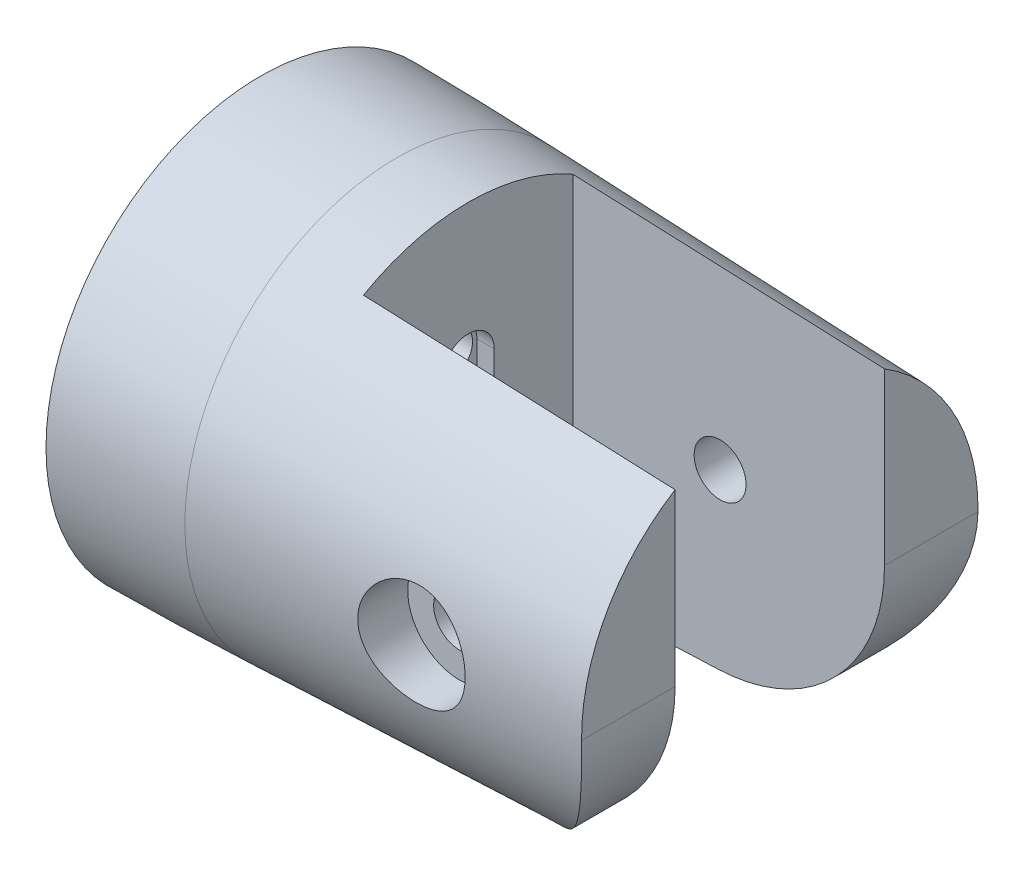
ISO-10303-21;
HEADER;
FILE_DESCRIPTION(('STEP AP214'),'2;1');
FILE_NAME('part.step','',(''),(''),'','','');
FILE_SCHEMA(('AUTOMOTIVE_DESIGN { 1 0 10303 214 1 1 1 1 }'));
ENDSEC;
DATA;
#1=APPLICATION_CONTEXT('core data for automotive mechanical design processes');
#2=APPLICATION_PROTOCOL_DEFINITION('international standard','automotive_design',2000,#1);
#3=PRODUCT_CONTEXT('',#1,'mechanical');
#4=PRODUCT('Part','Part','',(#3));
#5=PRODUCT_RELATED_PRODUCT_CATEGORY('part','',(#4));
#6=PRODUCT_DEFINITION_FORMATION('','',#4);
#7=PRODUCT_DEFINITION_CONTEXT('part definition',#1,'design');
#8=PRODUCT_DEFINITION('design','',#6,#7);
#9=PRODUCT_DEFINITION_SHAPE('','',#8);
#10=(LENGTH_UNIT() NAMED_UNIT(*) SI_UNIT(.MILLI.,.METRE.));
#11=(NAMED_UNIT(*) PLANE_ANGLE_UNIT() SI_UNIT($,.RADIAN.));
#12=(NAMED_UNIT(*) SI_UNIT($,.STERADIAN.) SOLID_ANGLE_UNIT());
#13=UNCERTAINTY_MEASURE_WITH_UNIT(LENGTH_MEASURE(1.E-05),#10,'distance_accuracy_value','');
#14=(GEOMETRIC_REPRESENTATION_CONTEXT(3) GLOBAL_UNCERTAINTY_ASSIGNED_CONTEXT((#13)) GLOBAL_UNIT_ASSIGNED_CONTEXT((#10,
#11,#12)) REPRESENTATION_CONTEXT('',''));
#15=CARTESIAN_POINT('',(0.,0.,0.));
#16=DIRECTION('',(0.,0.,1.));
#17=DIRECTION('',(1.,0.,0.));
#18=AXIS2_PLACEMENT_3D('',#15,#16,#17);
#19=CARTESIAN_POINT('',(20.5,-0.0779261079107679,-12.5));
#20=DIRECTION('',(0.,0.,1.));
#21=DIRECTION('',(1.,0.,0.));
#22=AXIS2_PLACEMENT_3D('',#19,#20,#21);
#23=CYLINDRICAL_SURFACE('',#22,1.5);
#24=CARTESIAN_POINT('',(20.5,-0.0779261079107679,-6.05));
#25=DIRECTION('',(0.,0.,-1.));
#26=DIRECTION('',(-1.,0.,0.));
#27=AXIS2_PLACEMENT_3D('',#24,#25,#26);
#28=CIRCLE('',#27,1.5);
#29=CARTESIAN_POINT('',(19.,-0.0779261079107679,-6.05));
#30=VERTEX_POINT('',#29);
#31=EDGE_CURVE('E244',#30,#30,#28,.T.);
#32=ORIENTED_EDGE('',*,*,#31,.F.);
#33=EDGE_LOOP('',(#32));
#34=FACE_BOUND('',#33,.T.);
#35=CARTESIAN_POINT('',(20.5,-0.0779261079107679,-9.));
#36=DIRECTION('',(0.,0.,-1.));
#37=DIRECTION('',(-1.,0.,0.));
#38=AXIS2_PLACEMENT_3D('',#35,#36,#37);
#39=CIRCLE('',#38,1.5);
#40=CARTESIAN_POINT('',(19.,-0.0779261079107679,-9.));
#41=VERTEX_POINT('',#40);
#42=EDGE_CURVE('E39',#41,#41,#39,.F.);
#43=ORIENTED_EDGE('',*,*,#42,.F.);
#44=EDGE_LOOP('',(#43));
#45=FACE_BOUND('',#44,.T.);
#46=ADVANCED_FACE('F35',(#34,#45),#23,.F.);
#47=CARTESIAN_POINT('',(20.5,-0.0779261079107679,6.05));
#48=DIRECTION('',(0.,0.,1.));
#49=DIRECTION('',(1.,0.,0.));
#50=AXIS2_PLACEMENT_3D('',#47,#48,#49);
#51=CIRCLE('',#50,1.5);
#52=CARTESIAN_POINT('',(22.,-0.0779261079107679,6.05));
#53=VERTEX_POINT('',#52);
#54=EDGE_CURVE('E245',#53,#53,#51,.T.);
#55=ORIENTED_EDGE('',*,*,#54,.F.);
#56=EDGE_LOOP('',(#55));
#57=FACE_BOUND('',#56,.T.);
#58=CARTESIAN_POINT('',(20.5,-0.0779261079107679,9.));
#59=DIRECTION('',(0.,0.,1.));
#60=DIRECTION('',(1.,0.,0.));
#61=AXIS2_PLACEMENT_3D('',#58,#59,#60);
#62=CIRCLE('',#61,1.5);
#63=CARTESIAN_POINT('',(22.,-0.0779261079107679,9.));
#64=VERTEX_POINT('',#63);
#65=EDGE_CURVE('E192',#64,#64,#62,.F.);
#66=ORIENTED_EDGE('',*,*,#65,.F.);
#67=EDGE_LOOP('',(#66));
#68=FACE_BOUND('',#67,.T.);
#69=ADVANCED_FACE('F372',(#57,#68),#23,.F.);
#70=CARTESIAN_POINT('',(-2.61885806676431,0.,0.));
#71=DIRECTION('',(-1.,0.,0.));
#72=DIRECTION('',(0.,0.,1.));
#73=AXIS2_PLACEMENT_3D('',#70,#71,#72);
#74=DEGENERATE_TOROIDAL_SURFACE('',#73,287.591410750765,300.,.F.);
#75=CARTESIAN_POINT('',(7.85099094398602,0.,0.));
#76=DIRECTION('',(-1.,0.,0.));
#77=DIRECTION('',(0.,0.,1.));
#78=AXIS2_PLACEMENT_3D('',#75,#76,#77);
#79=CIRCLE('',#78,12.2258373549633);
#80=CARTESIAN_POINT('',(7.85099094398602,0.,12.2258373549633));
#81=VERTEX_POINT('',#80);
#82=EDGE_CURVE('E324',#81,#81,#79,.F.);
#83=ORIENTED_EDGE('',*,*,#82,.F.);
#84=EDGE_LOOP('',(#83));
#85=FACE_BOUND('',#84,.T.);
#86=CARTESIAN_POINT('',(0.,0.,0.));
#87=DIRECTION('',(-1.,0.,0.));
#88=DIRECTION('',(0.,0.,1.));
#89=AXIS2_PLACEMENT_3D('',#86,#87,#88);
#90=CIRCLE('',#89,12.3971583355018);
#91=CARTESIAN_POINT('',(0.,0.,12.3971583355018));
#92=VERTEX_POINT('',#91);
#93=EDGE_CURVE('E163',#92,#92,#90,.F.);
#94=ORIENTED_EDGE('',*,*,#93,.T.);
#95=EDGE_LOOP('',(#94));
#96=FACE_BOUND('',#95,.T.);
#97=ADVANCED_FACE('F37',(#85,#96),#74,.F.);
#98=CARTESIAN_POINT('',(0.,0.,0.));
#99=DIRECTION('',(-1.,0.,0.));
#100=DIRECTION('',(0.,0.,-1.));
#101=AXIS2_PLACEMENT_3D('',#98,#99,#100);
#102=CONICAL_SURFACE('',#101,12.5,0.0349065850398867);
#103=CARTESIAN_POINT('',(27.1790693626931,2.92207389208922,-11.1751711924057));
#104=CARTESIAN_POINT('',(24.5172285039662,2.92207389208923,-11.2712460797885));
#105=CARTESIAN_POINT('',(21.8553849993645,2.92207389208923,-11.3672475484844));
#106=CARTESIAN_POINT('',(16.5316926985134,2.92207389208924,-11.5591036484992));
#107=CARTESIAN_POINT('',(13.869843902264,2.92207389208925,-11.6549582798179));
#108=CARTESIAN_POINT('',(11.2079924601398,2.92207389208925,-11.7507394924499));
#109=B_SPLINE_CURVE_WITH_KNOTS('',3,(#103,#104,#105,#106,#107,#108),.UNSPECIFIED.,.F.,.F.,(4,2,
4),(0.,7.99072237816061,15.981444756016),.UNSPECIFIED.);
#110=CARTESIAN_POINT('',(22.2320508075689,2.92207389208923,-11.3536430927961));
#111=VERTEX_POINT('',#110);
#112=CARTESIAN_POINT('',(18.7679491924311,2.92207389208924,-11.4785121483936));
#113=VERTEX_POINT('',#112);
#114=EDGE_CURVE('E44',#111,#113,#109,.T.);
#115=ORIENTED_EDGE('',*,*,#114,.T.);
#116=CARTESIAN_POINT('',(16.9422726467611,-0.240090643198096,0.));
#117=DIRECTION('',(-0.866025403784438,0.500000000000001,0.));
#118=DIRECTION('',(-0.500000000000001,-0.866025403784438,0.));
#119=AXIS2_PLACEMENT_3D('',#116,#117,#118);
#120=ELLIPSE('',#119,13.7505929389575,11.9059422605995);
#121=CARTESIAN_POINT('',(17.0358983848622,-0.0779261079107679,-11.9048382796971));
#122=VERTEX_POINT('',#121);
#123=EDGE_CURVE('E11',#113,#122,#120,.T.);
#124=ORIENTED_EDGE('',*,*,#123,.T.);
#125=CARTESIAN_POINT('',(16.8522547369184,0.240154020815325,0.));
#126=DIRECTION('',(-0.86602540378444,-0.499999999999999,0.));
#127=DIRECTION('',(-0.499999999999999,0.86602540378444,0.));
#128=AXIS2_PLACEMENT_3D('',#125,#126,#127);
#129=ELLIPSE('',#128,13.7542227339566,11.9090851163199);
#130=CARTESIAN_POINT('',(18.7679491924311,-3.07792610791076,-11.437706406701));
#131=VERTEX_POINT('',#130);
#132=EDGE_CURVE('E161',#122,#131,#129,.T.);
#133=ORIENTED_EDGE('',*,*,#132,.T.);
#134=CARTESIAN_POINT('',(11.2065309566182,-3.07792610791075,-11.7109351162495));
#135=CARTESIAN_POINT('',(13.8683706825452,-3.07792610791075,-11.6148288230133));
#136=CARTESIAN_POINT('',(16.5302074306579,-3.07792610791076,-11.5186401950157));
#137=CARTESIAN_POINT('',(21.8538749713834,-3.07792610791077,-11.3260982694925));
#138=CARTESIAN_POINT('',(24.5157057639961,-3.07792610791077,-11.2297449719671));
#139=CARTESIAN_POINT('',(27.1775335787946,-3.07792610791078,-11.13330933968));
#140=B_SPLINE_CURVE_WITH_KNOTS('',3,(#134,#135,#136,#137,#138,#139),.UNSPECIFIED.,.F.,.F.,(4,2,
4),(0.,7.99072237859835,15.9814447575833),.UNSPECIFIED.);
#141=CARTESIAN_POINT('',(22.2320508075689,-3.07792610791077,-11.3123869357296));
#142=VERTEX_POINT('',#141);
#143=EDGE_CURVE('E417',#131,#142,#140,.T.);
#144=ORIENTED_EDGE('',*,*,#143,.T.);
#145=CARTESIAN_POINT('',(23.8732932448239,-0.235210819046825,0.));
#146=DIRECTION('',(0.866025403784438,-0.500000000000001,0.));
#147=DIRECTION('',(-0.500000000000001,-0.866025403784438,0.));
#148=AXIS2_PLACEMENT_3D('',#145,#146,#147);
#149=ELLIPSE('',#148,13.471113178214,11.6639548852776);
#150=CARTESIAN_POINT('',(23.9641016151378,-0.0779261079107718,-11.6628948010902));
#151=VERTEX_POINT('',#150);
#152=EDGE_CURVE('E415',#142,#151,#149,.T.);
#153=ORIENTED_EDGE('',*,*,#152,.T.);
#154=CARTESIAN_POINT('',(23.7832753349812,0.235274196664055,0.));
#155=DIRECTION('',(0.86602540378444,0.499999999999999,0.));
#156=DIRECTION('',(-0.499999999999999,0.86602540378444,0.));
#157=AXIS2_PLACEMENT_3D('',#154,#155,#156);
#158=ELLIPSE('',#157,13.474742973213,11.667097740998);
#159=EDGE_CURVE('E408',#151,#111,#158,.T.);
#160=ORIENTED_EDGE('',*,*,#159,.T.);
#161=EDGE_LOOP('',(#115,#124,#133,#144,#153,#160));
#162=FACE_BOUND('',#161,.T.);
#163=CARTESIAN_POINT('',(29.999999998,-0.122642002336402,-11.4517202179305));
#164=CARTESIAN_POINT('',(30.0000038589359,-0.242247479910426,-11.4504410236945));
#165=CARTESIAN_POINT('',(29.9978583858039,-0.361815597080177,-11.4473589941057));
#166=CARTESIAN_POINT('',(29.9892932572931,-0.600645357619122,-11.4376136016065));
#167=CARTESIAN_POINT('',(29.9828738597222,-0.719907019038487,-11.4309504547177));
#168=CARTESIAN_POINT('',(29.9572578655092,-1.07667308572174,-11.4056418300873));
#169=CARTESIAN_POINT('',(29.9317033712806,-1.31339392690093,-11.381674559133));
#170=CARTESIAN_POINT('',(29.864407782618,-1.78079599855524,-11.3203066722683));
#171=CARTESIAN_POINT('',(29.8227936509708,-2.01150981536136,-11.2830115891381));
#172=CARTESIAN_POINT('',(29.7241147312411,-2.4671840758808,-11.1957364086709));
#173=CARTESIAN_POINT('',(29.6670478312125,-2.69214372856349,-11.1457545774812));
#174=CARTESIAN_POINT('',(29.538581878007,-3.13420223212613,-11.0342582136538));
#175=CARTESIAN_POINT('',(29.4672260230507,-3.35132250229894,-10.9727784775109));
#176=CARTESIAN_POINT('',(29.3110507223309,-3.77740752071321,-10.8392634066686));
#177=CARTESIAN_POINT('',(29.2262253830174,-3.98636864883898,-10.767223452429));
#178=CARTESIAN_POINT('',(29.0440364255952,-4.39550202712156,-10.6136724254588));
#179=CARTESIAN_POINT('',(28.9466558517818,-4.59566189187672,-10.5321485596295));
#180=CARTESIAN_POINT('',(28.740428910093,-4.98635076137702,-10.3608953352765));
#181=CARTESIAN_POINT('',(28.6315800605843,-5.17687766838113,-10.2711642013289));
#182=CARTESIAN_POINT('',(28.3599994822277,-5.61835881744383,-10.0492793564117));
#183=CARTESIAN_POINT('',(28.1924974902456,-5.86480007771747,-9.91395103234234));
#184=CARTESIAN_POINT('',(27.8394654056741,-6.33814806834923,-9.63298446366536));
#185=CARTESIAN_POINT('',(27.6539288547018,-6.5650477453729,-9.48734253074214));
#186=CARTESIAN_POINT('',(27.2658831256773,-6.99976578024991,-9.1883595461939));
#187=CARTESIAN_POINT('',(27.0633267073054,-7.20752743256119,-9.03499757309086));
#188=CARTESIAN_POINT('',(26.6428040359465,-7.60325114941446,-8.72409066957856));
#189=CARTESIAN_POINT('',(26.4248401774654,-7.79121627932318,-8.56654639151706));
#190=CARTESIAN_POINT('',(25.9693548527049,-8.1510904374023,-8.24738240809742));
#191=CARTESIAN_POINT('',(25.7315251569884,-8.32259378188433,-8.08574511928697));
#192=CARTESIAN_POINT('',(25.240046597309,-8.64507016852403,-7.7657007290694));
#193=CARTESIAN_POINT('',(24.9863903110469,-8.79603347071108,-7.60729519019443));
#194=CARTESIAN_POINT('',(24.4633175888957,-9.07642055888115,-7.29962296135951));
#195=CARTESIAN_POINT('',(24.1939511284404,-9.20590809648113,-7.15033008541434));
#196=CARTESIAN_POINT('',(23.6378801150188,-9.44255883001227,-6.8678169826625));
#197=CARTESIAN_POINT('',(23.351196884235,-9.54974878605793,-6.73457757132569));
#198=CARTESIAN_POINT('',(22.7491429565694,-9.74287552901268,-6.49014756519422));
#199=CARTESIAN_POINT('',(22.4331428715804,-9.8280087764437,-6.37981384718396));
#200=CARTESIAN_POINT('',(21.9462639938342,-9.93301661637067,-6.24629503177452));
#201=CARTESIAN_POINT('',(21.7821345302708,-9.96420101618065,-6.20716132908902));
#202=CARTESIAN_POINT('',(21.4501467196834,-10.0185637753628,-6.14124312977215));
#203=CARTESIAN_POINT('',(21.2822909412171,-10.0417474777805,-6.11445038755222));
#204=CARTESIAN_POINT('',(20.996433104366,-10.0737677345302,-6.08086037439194));
#205=CARTESIAN_POINT('',(20.8790940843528,-10.084823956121,-6.07044011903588));
#206=CARTESIAN_POINT('',(20.6434375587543,-10.1028232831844,-6.05644972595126));
#207=CARTESIAN_POINT('',(20.525118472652,-10.1097573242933,-6.05289464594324));
#208=CARTESIAN_POINT('',(20.4066821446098,-10.114569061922,-6.05292405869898));
#209=B_SPLINE_CURVE_WITH_KNOTS('',3,(#163,#164,#165,#166,#167,#168,#169,#170,#171,#172,#173,
#174,#175,#176,#177,#178,#179,#180,#181,#182,#183,#184,#185,#186,#187,#188,#189,#190,#191,#192,
#193,#194,#195,#196,#197,#198,#199,#200,#201,#202,#203,#204,#205,#206,#207,#208),.UNSPECIFIED.,
.F.,.F.,(4,2,2,2,2,2,2,2,2,2,2,2,2,2,2,2,2,2,2,2,2,2,4),(0.,0.358768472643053,0.717515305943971,
1.43430564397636,2.14554164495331,2.85687490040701,3.56608927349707,4.27561482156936,
4.98610881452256,5.6967568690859,6.67714163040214,7.65787878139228,8.64143417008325,
9.62483703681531,10.6282978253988,11.6322328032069,12.6331320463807,13.6328230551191,
14.6649895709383,15.1792068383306,15.6930800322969,16.0477782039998,16.4032534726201),.UNSPECIFIED.);
#210=CARTESIAN_POINT('',(30.,-0.122842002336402,-11.4517180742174));
#211=VERTEX_POINT('',#210);
#212=CARTESIAN_POINT('',(20.4068821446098,-10.1145609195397,-6.05292406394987));
#213=VERTEX_POINT('',#212);
#214=EDGE_CURVE('E265',#211,#213,#209,.T.);
#215=ORIENTED_EDGE('',*,*,#214,.T.);
#216=CARTESIAN_POINT('',(21.0000000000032,-10.0904080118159,0.));
#217=DIRECTION('',(-0.0406882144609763,0.999171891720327,0.));
#218=DIRECTION('',(-0.999171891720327,-0.0406882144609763,0.));
#219=AXIS2_PLACEMENT_3D('',#216,#217,#218);
#220=ELLIPSE('',#219,289.190960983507,6.05293681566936);
#221=CARTESIAN_POINT('',(12.,-10.4569054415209,-6.05));
#222=VERTEX_POINT('',#221);
#223=EDGE_CURVE('E667',#213,#222,#220,.T.);
#224=ORIENTED_EDGE('',*,*,#223,.T.);
#225=CARTESIAN_POINT('',(12.,0.,0.));
#226=DIRECTION('',(-1.,0.,0.));
#227=DIRECTION('',(0.,0.,1.));
#228=AXIS2_PLACEMENT_3D('',#225,#226,#227);
#229=CIRCLE('',#228,12.080950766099);
#230=CARTESIAN_POINT('',(12.,-10.4569054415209,6.05));
#231=VERTEX_POINT('',#230);
#232=EDGE_CURVE('E317',#222,#231,#229,.T.);
#233=ORIENTED_EDGE('',*,*,#232,.T.);
#234=CARTESIAN_POINT('',(20.4068821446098,-10.1145609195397,6.05292406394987));
#235=VERTEX_POINT('',#234);
#236=EDGE_CURVE('E660',#231,#235,#220,.T.);
#237=ORIENTED_EDGE('',*,*,#236,.T.);
#238=CARTESIAN_POINT('',(20.4066821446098,-10.114569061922,6.05292405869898));
#239=CARTESIAN_POINT('',(20.5777279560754,-10.1076488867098,6.05279007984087));
#240=CARTESIAN_POINT('',(20.7484940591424,-10.096259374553,6.06027259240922));
#241=CARTESIAN_POINT('',(21.0876672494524,-10.0649590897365,6.0892993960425));
#242=CARTESIAN_POINT('',(21.25607875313,-10.0450674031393,6.11081224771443));
#243=CARTESIAN_POINT('',(21.5869051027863,-9.99752159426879,6.16629961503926));
#244=CARTESIAN_POINT('',(21.7493725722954,-9.96999410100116,6.20007340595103));
#245=CARTESIAN_POINT('',(22.0702876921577,-9.90755673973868,6.27845702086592));
#246=CARTESIAN_POINT('',(22.228732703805,-9.8726421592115,6.32307376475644));
#247=CARTESIAN_POINT('',(22.6096764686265,-9.77909227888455,6.44298176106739));
#248=CARTESIAN_POINT('',(22.8297393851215,-9.71677418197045,6.52313830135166));
#249=CARTESIAN_POINT('',(23.2600726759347,-9.57921662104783,6.69732376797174));
#250=CARTESIAN_POINT('',(23.47033864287,-9.50397141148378,6.79135886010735));
#251=CARTESIAN_POINT('',(23.8831738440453,-9.34079476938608,6.99008507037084));
#252=CARTESIAN_POINT('',(24.0856591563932,-9.25275761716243,7.09486260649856));
#253=CARTESIAN_POINT('',(24.4814357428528,-9.06513945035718,7.31107533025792));
#254=CARTESIAN_POINT('',(24.6747274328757,-8.96555895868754,7.42251021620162));
#255=CARTESIAN_POINT('',(25.143308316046,-8.70473371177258,7.70390680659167));
#256=CARTESIAN_POINT('',(25.4134505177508,-8.53682408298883,7.87630017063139));
#257=CARTESIAN_POINT('',(25.935623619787,-8.17696595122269,8.22361124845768));
#258=CARTESIAN_POINT('',(26.1876463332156,-7.98500668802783,8.39853006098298));
#259=CARTESIAN_POINT('',(26.67273606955,-7.57767980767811,8.74538920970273));
#260=CARTESIAN_POINT('',(26.9058528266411,-7.36237733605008,8.91733635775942));
#261=CARTESIAN_POINT('',(27.352857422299,-6.90789871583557,9.25438688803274));
#262=CARTESIAN_POINT('',(27.5667534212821,-6.668732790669,9.4194931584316));
#263=CARTESIAN_POINT('',(27.9260355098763,-6.22523984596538,9.7015164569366));
#264=CARTESIAN_POINT('',(28.0757499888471,-6.02583391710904,9.82067764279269));
#265=CARTESIAN_POINT('',(28.3617739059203,-5.61317305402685,10.0508005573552));
#266=CARTESIAN_POINT('',(28.4980862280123,-5.39992111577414,10.1617640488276));
#267=CARTESIAN_POINT('',(28.7559248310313,-4.96006476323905,10.3735811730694));
#268=CARTESIAN_POINT('',(28.8774605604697,-4.73346902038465,10.4744412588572));
#269=CARTESIAN_POINT('',(29.1043254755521,-4.26752028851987,10.6642306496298));
#270=CARTESIAN_POINT('',(29.209657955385,-4.02816990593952,10.7531623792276));
#271=CARTESIAN_POINT('',(29.3865098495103,-3.57852272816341,10.9036131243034));
#272=CARTESIAN_POINT('',(29.460739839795,-3.36999201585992,10.967232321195));
#273=CARTESIAN_POINT('',(29.5958634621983,-2.94577193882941,11.0838246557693));
#274=CARTESIAN_POINT('',(29.6567597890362,-2.73008403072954,11.1367999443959));
#275=CARTESIAN_POINT('',(29.7642561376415,-2.293061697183,11.2310870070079));
#276=CARTESIAN_POINT('',(29.8108796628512,-2.07173721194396,11.2724179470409));
#277=CARTESIAN_POINT('',(29.8891946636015,-1.6246092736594,11.3427246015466));
#278=CARTESIAN_POINT('',(29.9208932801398,-1.39880801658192,11.3717062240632));
#279=CARTESIAN_POINT('',(29.9631748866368,-0.997859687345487,11.4114476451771));
#280=CARTESIAN_POINT('',(29.9769727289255,-0.823307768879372,11.424891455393));
#281=CARTESIAN_POINT('',(29.9953915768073,-0.473406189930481,11.444093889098));
#282=CARTESIAN_POINT('',(30.0000180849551,-0.298057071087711,11.449857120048));
#283=CARTESIAN_POINT('',(29.999999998,-0.122642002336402,11.4517202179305));
#284=B_SPLINE_CURVE_WITH_KNOTS('',3,(#238,#239,#240,#241,#242,#243,#244,#245,#246,#247,#248,
#249,#250,#251,#252,#253,#254,#255,#256,#257,#258,#259,#260,#261,#262,#263,#264,#265,#266,#267,
#268,#269,#270,#271,#272,#273,#274,#275,#276,#277,#278,#279,#280,#281,#282,#283),.UNSPECIFIED.,
.F.,.F.,(4,2,2,2,2,2,2,2,2,2,2,2,2,2,2,2,2,2,2,2,2,2,4),(0.,0.513181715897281,1.02521741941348,
1.52922297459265,2.03355103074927,2.75941171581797,3.48559585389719,4.21816452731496,
4.95070002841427,6.03465007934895,7.11908685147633,8.20057153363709,9.28159486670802,
10.1099727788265,10.9381720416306,11.7658389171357,12.5933373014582,13.2835787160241,
13.9736805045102,14.662639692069,15.3512689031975,15.8777108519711,16.4038368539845),.UNSPECIFIED.);
#285=CARTESIAN_POINT('',(30.,-0.122842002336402,11.4517180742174));
#286=VERTEX_POINT('',#285);
#287=EDGE_CURVE('E258',#235,#286,#284,.T.);
#288=ORIENTED_EDGE('',*,*,#287,.T.);
#289=CARTESIAN_POINT('',(30.,0.,0.));
#290=DIRECTION('',(1.,0.,0.));
#291=DIRECTION('',(0.,0.,-1.));
#292=AXIS2_PLACEMENT_3D('',#289,#290,#291);
#293=CIRCLE('',#292,11.4523769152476);
#294=CARTESIAN_POINT('',(30.,9.72391058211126,6.05));
#295=VERTEX_POINT('',#294);
#296=EDGE_CURVE('E307',#295,#286,#293,.T.);
#297=ORIENTED_EDGE('',*,*,#296,.F.);
#298=CARTESIAN_POINT('',(-6.48507262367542,11.1964449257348,6.05000000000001));
#299=CARTESIAN_POINT('',(-2.64794589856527,11.0441321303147,6.05));
#300=CARTESIAN_POINT('',(1.18915358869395,10.8911308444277,6.05));
#301=CARTESIAN_POINT('',(8.86328985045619,10.5835350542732,6.05));
#302=CARTESIAN_POINT('',(12.7003266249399,10.4289405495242,6.05));
#303=CARTESIAN_POINT('',(20.3743269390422,10.1179421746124,6.05));
#304=CARTESIAN_POINT('',(24.2112904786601,9.96153830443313,6.05));
#305=CARTESIAN_POINT('',(31.885131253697,9.64664613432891,6.05));
#306=CARTESIAN_POINT('',(35.7220084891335,9.48815783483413,6.05));
#307=CARTESIAN_POINT('',(44.4627885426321,9.12435129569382,6.05));
#308=CARTESIAN_POINT('',(49.366659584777,8.91826819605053,6.05));
#309=CARTESIAN_POINT('',(59.174195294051,8.50126377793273,6.05));
#310=CARTESIAN_POINT('',(64.0778599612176,8.29034246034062,6.05));
#311=CARTESIAN_POINT('',(73.8849362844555,7.86244456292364,6.04999999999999));
#312=CARTESIAN_POINT('',(78.7883479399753,7.64546797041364,6.04999999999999));
#313=CARTESIAN_POINT('',(86.1432040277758,7.31415519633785,6.04999999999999));
#314=CARTESIAN_POINT('',(88.5947801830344,7.20274290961,6.04999999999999));
#315=CARTESIAN_POINT('',(93.4978292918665,6.97765955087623,6.04999999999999));
#316=CARTESIAN_POINT('',(95.9493022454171,6.8639884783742,6.04999999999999));
#317=CARTESIAN_POINT('',(98.4007153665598,6.7490332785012,6.04999999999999));
#318=B_SPLINE_CURVE_WITH_KNOTS('',3,(#298,#299,#300,#301,#302,#303,#304,#305,#306,#307,#308,
#309,#310,#311,#312,#313,#314,#315,#316,#317),.UNSPECIFIED.,.F.,.F.,(4,2,2,2,2,2,2,2,2,4),(0.,
11.5204456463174,23.0408947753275,34.5613440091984,46.0817908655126,60.8063870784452,
75.5309806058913,90.2556049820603,97.6179233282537,104.980243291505),.UNSPECIFIED.);
#319=CARTESIAN_POINT('',(12.,10.4569054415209,6.05));
#320=VERTEX_POINT('',#319);
#321=EDGE_CURVE('E293',#295,#320,#318,.F.);
#322=ORIENTED_EDGE('',*,*,#321,.T.);
#323=CARTESIAN_POINT('',(12.,10.4569054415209,-6.05));
#324=VERTEX_POINT('',#323);
#325=EDGE_CURVE('E314',#320,#324,#229,.T.);
#326=ORIENTED_EDGE('',*,*,#325,.T.);
#327=CARTESIAN_POINT('',(-6.48507262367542,11.1964449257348,-6.04999999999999));
#328=CARTESIAN_POINT('',(-2.64794589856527,11.0441321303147,-6.05));
#329=CARTESIAN_POINT('',(1.18915358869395,10.8911308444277,-6.05));
#330=CARTESIAN_POINT('',(8.86328985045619,10.5835350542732,-6.05));
#331=CARTESIAN_POINT('',(12.7003266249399,10.4289405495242,-6.05));
#332=CARTESIAN_POINT('',(20.3743269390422,10.1179421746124,-6.05));
#333=CARTESIAN_POINT('',(24.2112904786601,9.96153830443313,-6.05));
#334=CARTESIAN_POINT('',(31.885131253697,9.64664613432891,-6.05));
#335=CARTESIAN_POINT('',(35.7220084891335,9.48815783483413,-6.05));
#336=CARTESIAN_POINT('',(44.4627885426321,9.12435129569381,-6.05));
#337=CARTESIAN_POINT('',(49.366659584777,8.91826819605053,-6.05));
#338=CARTESIAN_POINT('',(59.174195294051,8.50126377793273,-6.05));
#339=CARTESIAN_POINT('',(64.0778599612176,8.29034246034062,-6.05));
#340=CARTESIAN_POINT('',(73.8849362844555,7.86244456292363,-6.05000000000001));
#341=CARTESIAN_POINT('',(78.7883479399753,7.64546797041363,-6.05000000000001));
#342=CARTESIAN_POINT('',(86.1432040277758,7.31415519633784,-6.05000000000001));
#343=CARTESIAN_POINT('',(88.5947801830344,7.20274290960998,-6.05000000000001));
#344=CARTESIAN_POINT('',(93.4978292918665,6.97765955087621,-6.05000000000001));
#345=CARTESIAN_POINT('',(95.9493022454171,6.86398847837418,-6.05000000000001));
#346=CARTESIAN_POINT('',(98.4007153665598,6.74903327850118,-6.05000000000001));
#347=B_SPLINE_CURVE_WITH_KNOTS('',3,(#327,#328,#329,#330,#331,#332,#333,#334,#335,#336,#337,
#338,#339,#340,#341,#342,#343,#344,#345,#346),.UNSPECIFIED.,.F.,.F.,(4,2,2,2,2,2,2,2,2,4),(0.,
11.5204456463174,23.0408947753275,34.5613440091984,46.0817908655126,60.8063870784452,
75.5309806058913,90.2556049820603,97.6179233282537,104.980243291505),.UNSPECIFIED.);
#348=CARTESIAN_POINT('',(30.,9.72391058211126,-6.05));
#349=VERTEX_POINT('',#348);
#350=EDGE_CURVE('E301',#324,#349,#347,.T.);
#351=ORIENTED_EDGE('',*,*,#350,.T.);
#352=EDGE_CURVE('E300',#211,#349,#293,.T.);
#353=ORIENTED_EDGE('',*,*,#352,.F.);
#354=EDGE_LOOP('',(#215,#224,#233,#237,#288,#297,#322,#326,#351,#353));
#355=FACE_BOUND('',#354,.T.);
#356=ORIENTED_EDGE('',*,*,#82,.T.);
#357=EDGE_LOOP('',(#356));
#358=FACE_BOUND('',#357,.T.);
#359=CARTESIAN_POINT('',(18.4443083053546,-2.26290474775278,11.6379498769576));
#360=CARTESIAN_POINT('',(18.5668948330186,-2.37823295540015,11.611164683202));
#361=CARTESIAN_POINT('',(18.699222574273,-2.48325037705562,11.5842300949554));
#362=CARTESIAN_POINT('',(18.9799703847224,-2.66982512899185,11.5325989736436));
#363=CARTESIAN_POINT('',(19.1283983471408,-2.75137087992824,11.5079035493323));
#364=CARTESIAN_POINT('',(19.437634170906,-2.88862231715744,11.4630879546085));
#365=CARTESIAN_POINT('',(19.5984553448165,-2.94429975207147,11.4429727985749));
#366=CARTESIAN_POINT('',(19.9278165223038,-3.02774756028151,11.4092799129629));
#367=CARTESIAN_POINT('',(20.0963539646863,-3.05552712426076,11.39570003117));
#368=CARTESIAN_POINT('',(20.4319507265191,-3.08175644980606,11.3764932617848));
#369=CARTESIAN_POINT('',(20.5989441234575,-3.08091211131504,11.3706786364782));
#370=CARTESIAN_POINT('',(20.93056281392,-3.05152963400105,11.3666088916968));
#371=CARTESIAN_POINT('',(21.0951882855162,-3.02299358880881,11.3683532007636));
#372=CARTESIAN_POINT('',(21.4139451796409,-2.93996867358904,11.3786047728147));
#373=CARTESIAN_POINT('',(21.5682215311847,-2.88601656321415,11.3869744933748));
#374=CARTESIAN_POINT('',(21.8656833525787,-2.75400441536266,11.4089332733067));
#375=CARTESIAN_POINT('',(22.0088676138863,-2.67594175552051,11.4225229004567));
#376=CARTESIAN_POINT('',(22.2830360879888,-2.4962217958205,11.4533522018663));
#377=CARTESIAN_POINT('',(22.4137399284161,-2.39414803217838,11.4706557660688));
#378=CARTESIAN_POINT('',(22.6565079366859,-2.17000116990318,11.5065346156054));
#379=CARTESIAN_POINT('',(22.7685692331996,-2.04792499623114,11.5251100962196));
#380=CARTESIAN_POINT('',(22.9736785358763,-1.78367237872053,11.5617408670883));
#381=CARTESIAN_POINT('',(23.0661870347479,-1.64107307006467,11.5797718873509));
#382=CARTESIAN_POINT('',(23.2259495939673,-1.34201983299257,11.6126096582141));
#383=CARTESIAN_POINT('',(23.2932048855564,-1.18556658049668,11.6274165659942));
#384=CARTESIAN_POINT('',(23.400067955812,-0.864129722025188,11.6519570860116));
#385=CARTESIAN_POINT('',(23.439837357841,-0.699202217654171,11.6617202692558));
#386=CARTESIAN_POINT('',(23.4910407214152,-0.364771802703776,11.6751756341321));
#387=CARTESIAN_POINT('',(23.5024790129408,-0.195269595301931,11.678868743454));
#388=CARTESIAN_POINT('',(23.496686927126,0.139525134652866,11.6798179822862));
#389=CARTESIAN_POINT('',(23.4800801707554,0.304828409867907,11.6772135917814));
#390=CARTESIAN_POINT('',(23.4199089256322,0.630249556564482,11.6662818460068));
#391=CARTESIAN_POINT('',(23.3763443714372,0.790367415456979,11.657954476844));
#392=CARTESIAN_POINT('',(23.2636562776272,1.10082523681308,11.6366979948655));
#393=CARTESIAN_POINT('',(23.1945566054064,1.25117417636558,11.623773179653));
#394=CARTESIAN_POINT('',(23.0327822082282,1.53829683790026,11.594971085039));
#395=CARTESIAN_POINT('',(22.9401042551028,1.67506869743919,11.5790934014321));
#396=CARTESIAN_POINT('',(22.7315186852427,1.93417544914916,11.5460578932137));
#397=CARTESIAN_POINT('',(22.6151699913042,2.05615295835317,11.5288803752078));
#398=CARTESIAN_POINT('',(22.3636018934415,2.27902747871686,11.495858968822));
#399=CARTESIAN_POINT('',(22.2283813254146,2.37992318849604,11.4800151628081));
#400=CARTESIAN_POINT('',(21.9416235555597,2.55844391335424,11.4518220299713));
#401=CARTESIAN_POINT('',(21.7899746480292,2.6358940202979,11.4394990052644));
#402=CARTESIAN_POINT('',(21.4754676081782,2.76413095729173,11.4204946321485));
#403=CARTESIAN_POINT('',(21.3126115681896,2.81492274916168,11.4138122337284));
#404=CARTESIAN_POINT('',(20.9841602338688,2.88741559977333,11.4075194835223));
#405=CARTESIAN_POINT('',(20.8187031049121,2.90972957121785,11.4077574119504));
#406=CARTESIAN_POINT('',(20.4865550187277,2.92664797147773,11.4154035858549));
#407=CARTESIAN_POINT('',(20.3198641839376,2.92125511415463,11.4228111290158));
#408=CARTESIAN_POINT('',(19.9927608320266,2.8833894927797,11.444205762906));
#409=CARTESIAN_POINT('',(19.8322905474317,2.85135102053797,11.4580857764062));
#410=CARTESIAN_POINT('',(19.5191817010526,2.76188302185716,11.4912235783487));
#411=CARTESIAN_POINT('',(19.3665440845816,2.70445043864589,11.5104820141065));
#412=CARTESIAN_POINT('',(19.0700572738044,2.56454737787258,11.5530709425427));
#413=CARTESIAN_POINT('',(18.9264427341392,2.48160243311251,11.5764746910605));
#414=CARTESIAN_POINT('',(18.6549623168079,2.29338793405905,11.6248874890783));
#415=CARTESIAN_POINT('',(18.5270994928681,2.18811406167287,11.649896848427));
#416=CARTESIAN_POINT('',(18.2868903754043,1.95456156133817,11.6998848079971));
#417=CARTESIAN_POINT('',(18.1750997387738,1.82570569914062,11.7248416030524));
#418=CARTESIAN_POINT('',(17.9747066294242,1.55052670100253,11.7714496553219));
#419=CARTESIAN_POINT('',(17.8861035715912,1.4042040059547,11.7931009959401));
#420=CARTESIAN_POINT('',(17.7352450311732,1.09891165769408,11.8307326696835));
#421=CARTESIAN_POINT('',(17.672841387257,0.940019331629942,11.8467448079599));
#422=CARTESIAN_POINT('',(17.575790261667,0.613444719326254,11.8715270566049));
#423=CARTESIAN_POINT('',(17.5411352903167,0.445764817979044,11.8802991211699));
#424=CARTESIAN_POINT('',(17.5015178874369,0.112562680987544,11.889428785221));
#425=CARTESIAN_POINT('',(17.4955771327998,-0.0528360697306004,11.8900648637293));
#426=CARTESIAN_POINT('',(17.5109222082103,-0.382211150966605,11.8835009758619));
#427=CARTESIAN_POINT('',(17.5322079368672,-0.546187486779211,11.8763010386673));
#428=CARTESIAN_POINT('',(17.6007043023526,-0.865565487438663,11.8548756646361));
#429=CARTESIAN_POINT('',(17.6475263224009,-1.02105817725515,11.8407558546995));
#430=CARTESIAN_POINT('',(17.7652932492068,-1.32189597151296,11.80681708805));
#431=CARTESIAN_POINT('',(17.8362310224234,-1.46724406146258,11.7869998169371));
#432=CARTESIAN_POINT('',(17.9900199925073,-1.72714546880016,11.7461119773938));
#433=CARTESIAN_POINT('',(18.070329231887,-1.8432869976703,11.7254960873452));
#434=CARTESIAN_POINT('',(18.2462604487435,-2.06298756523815,11.682604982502));
#435=CARTESIAN_POINT('',(18.3418841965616,-2.16654514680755,11.6603295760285));
#436=CARTESIAN_POINT('',(18.4443083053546,-2.26290474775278,11.6379498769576));
#437=B_SPLINE_CURVE_WITH_KNOTS('',3,(#359,#360,#361,#362,#363,#364,#365,#366,#367,#368,#369,
#370,#371,#372,#373,#374,#375,#376,#377,#378,#379,#380,#381,#382,#383,#384,#385,#386,#387,#388,
#389,#390,#391,#392,#393,#394,#395,#396,#397,#398,#399,#400,#401,#402,#403,#404,#405,#406,#407,
#408,#409,#410,#411,#412,#413,#414,#415,#416,#417,#418,#419,#420,#421,#422,#423,#424,#425,#426,
#427,#428,#429,#430,#431,#432,#433,#434,#435,#436),.UNSPECIFIED.,.T.,.F.,(4,2,2,2,2,2,2,2,2,2,2,
2,2,2,2,2,2,2,2,2,2,2,2,2,2,2,2,2,2,2,2,2,2,2,2,2,2,2,4),(0.,0.51078521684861,1.02182199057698,
1.53341557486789,2.04484056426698,2.54366258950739,3.04244690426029,3.53113979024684,
4.01988584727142,4.51783156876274,5.01585391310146,5.52620806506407,6.0365373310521,
6.54383961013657,7.05106435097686,7.54715812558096,8.04325310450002,8.53888555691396,
9.03458590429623,9.5405455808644,10.0465364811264,10.5562140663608,11.0657967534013,
11.5642160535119,12.0625865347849,12.5529898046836,13.0434521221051,13.543652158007,
14.043949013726,14.5587139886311,15.0734659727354,15.5852664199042,16.0969286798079,
16.5910289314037,17.0851273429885,17.57190815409,18.0585450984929,18.4852695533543,
18.912043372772),.UNSPECIFIED.);
#438=CARTESIAN_POINT('',(18.4443083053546,-2.26290474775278,11.6379498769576));
#439=VERTEX_POINT('',#438);
#440=EDGE_CURVE('E202',#439,#439,#437,.T.);
#441=ORIENTED_EDGE('',*,*,#440,.F.);
#442=EDGE_LOOP('',(#441));
#443=FACE_BOUND('',#442,.T.);
#444=ADVANCED_FACE('F270',(#162,#355,#358,#443),#102,.T.);
#445=CARTESIAN_POINT('',(30.,4.,0.));
#446=DIRECTION('',(-1.,0.,0.));
#447=DIRECTION('',(0.,0.,1.));
#448=AXIS2_PLACEMENT_3D('',#445,#446,#447);
#449=CYLINDRICAL_SURFACE('',#448,1.25);
#450=CARTESIAN_POINT('',(0.,4.,0.));
#451=DIRECTION('',(-1.,0.,0.));
#452=DIRECTION('',(0.,0.,1.));
#453=AXIS2_PLACEMENT_3D('',#450,#451,#452);
#454=CIRCLE('',#453,1.25);
#455=CARTESIAN_POINT('',(0.,4.,1.25));
#456=VERTEX_POINT('',#455);
#457=EDGE_CURVE('E196',#456,#456,#454,.F.);
#458=ORIENTED_EDGE('',*,*,#457,.F.);
#459=EDGE_LOOP('',(#458));
#460=FACE_BOUND('',#459,.T.);
#461=CARTESIAN_POINT('',(11.,4.,0.));
#462=DIRECTION('',(1.,0.,0.));
#463=DIRECTION('',(0.,0.,-1.));
#464=AXIS2_PLACEMENT_3D('',#461,#462,#463);
#465=CIRCLE('',#464,1.25);
#466=CARTESIAN_POINT('',(11.,4.,-1.25));
#467=VERTEX_POINT('',#466);
#468=EDGE_CURVE('E241',#467,#467,#465,.T.);
#469=ORIENTED_EDGE('',*,*,#468,.T.);
#470=EDGE_LOOP('',(#469));
#471=FACE_BOUND('',#470,.T.);
#472=ADVANCED_FACE('F367',(#460,#471),#449,.F.);
#473=CARTESIAN_POINT('',(30.,-4.,0.));
#474=DIRECTION('',(-1.,0.,0.));
#475=DIRECTION('',(0.,0.,1.));
#476=AXIS2_PLACEMENT_3D('',#473,#474,#475);
#477=CYLINDRICAL_SURFACE('',#476,1.25);
#478=CARTESIAN_POINT('',(0.,-4.,0.));
#479=DIRECTION('',(-1.,0.,0.));
#480=DIRECTION('',(0.,0.,1.));
#481=AXIS2_PLACEMENT_3D('',#478,#479,#480);
#482=CIRCLE('',#481,1.25);
#483=CARTESIAN_POINT('',(0.,-4.,1.25));
#484=VERTEX_POINT('',#483);
#485=EDGE_CURVE('E193',#484,#484,#482,.F.);
#486=ORIENTED_EDGE('',*,*,#485,.F.);
#487=EDGE_LOOP('',(#486));
#488=FACE_BOUND('',#487,.T.);
#489=CARTESIAN_POINT('',(11.,-4.,0.));
#490=DIRECTION('',(1.,0.,0.));
#491=DIRECTION('',(0.,0.,-1.));
#492=AXIS2_PLACEMENT_3D('',#489,#490,#491);
#493=CIRCLE('',#492,1.25);
#494=CARTESIAN_POINT('',(11.,-4.,-1.25));
#495=VERTEX_POINT('',#494);
#496=EDGE_CURVE('E235',#495,#495,#493,.T.);
#497=ORIENTED_EDGE('',*,*,#496,.T.);
#498=EDGE_LOOP('',(#497));
#499=FACE_BOUND('',#498,.T.);
#500=ADVANCED_FACE('F363',(#488,#499),#477,.F.);
#501=CARTESIAN_POINT('',(30.,0.,0.));
#502=DIRECTION('',(1.,0.,0.));
#503=DIRECTION('',(0.,0.,-1.));
#504=AXIS2_PLACEMENT_3D('',#501,#502,#503);
#505=PLANE('',#504);
#506=ORIENTED_EDGE('',*,*,#296,.T.);
#507=DIRECTION('',(0.,0.,1.));
#508=VECTOR('',#507,1.);
#509=CARTESIAN_POINT('',(30.,-0.122842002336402,-12.5));
#510=LINE('',#509,#508);
#511=CARTESIAN_POINT('',(30.,-0.122842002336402,6.05));
#512=VERTEX_POINT('',#511);
#513=EDGE_CURVE('E248',#512,#286,#510,.T.);
#514=ORIENTED_EDGE('',*,*,#513,.F.);
#515=DIRECTION('',(0.,-1.,0.));
#516=VECTOR('',#515,1.);
#517=CARTESIAN_POINT('',(30.,0.,6.05));
#518=LINE('',#517,#516);
#519=EDGE_CURVE('E311',#295,#512,#518,.T.);
#520=ORIENTED_EDGE('',*,*,#519,.F.);
#521=EDGE_LOOP('',(#506,#514,#520));
#522=FACE_BOUND('',#521,.T.);
#523=ADVANCED_FACE('F366',(#522),#505,.T.);
#524=DIRECTION('',(0.,1.,0.));
#525=VECTOR('',#524,1.);
#526=CARTESIAN_POINT('',(30.,0.,-6.05));
#527=LINE('',#526,#525);
#528=CARTESIAN_POINT('',(30.,-0.122842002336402,-6.05));
#529=VERTEX_POINT('',#528);
#530=EDGE_CURVE('E308',#529,#349,#527,.T.);
#531=ORIENTED_EDGE('',*,*,#530,.F.);
#532=EDGE_CURVE('E253',#211,#529,#510,.T.);
#533=ORIENTED_EDGE('',*,*,#532,.F.);
#534=ORIENTED_EDGE('',*,*,#352,.T.);
#535=EDGE_LOOP('',(#531,#533,#534));
#536=FACE_BOUND('',#535,.T.);
#537=ADVANCED_FACE('F576',(#536),#505,.T.);
#538=CARTESIAN_POINT('',(12.,-12.5,-6.05));
#539=DIRECTION('',(-1.,0.,0.));
#540=DIRECTION('',(0.,0.,1.));
#541=AXIS2_PLACEMENT_3D('',#538,#539,#540);
#542=PLANE('',#541);
#543=DIRECTION('',(0.,1.,0.));
#544=VECTOR('',#543,1.);
#545=CARTESIAN_POINT('',(12.,-4.,-1.5));
#546=LINE('',#545,#544);
#547=CARTESIAN_POINT('',(12.,-4.,-1.5));
#548=VERTEX_POINT('',#547);
#549=CARTESIAN_POINT('',(12.,4.,-1.5));
#550=VERTEX_POINT('',#549);
#551=EDGE_CURVE('E225',#548,#550,#546,.T.);
#552=ORIENTED_EDGE('',*,*,#551,.F.);
#553=CARTESIAN_POINT('',(12.,-4.,0.));
#554=DIRECTION('',(1.,0.,0.));
#555=DIRECTION('',(0.,0.,-1.));
#556=AXIS2_PLACEMENT_3D('',#553,#554,#555);
#557=CIRCLE('',#556,1.5);
#558=CARTESIAN_POINT('',(12.,-4.,1.5));
#559=VERTEX_POINT('',#558);
#560=EDGE_CURVE('E60',#559,#548,#557,.T.);
#561=ORIENTED_EDGE('',*,*,#560,.F.);
#562=DIRECTION('',(0.,-1.,0.));
#563=VECTOR('',#562,1.);
#564=CARTESIAN_POINT('',(12.,-4.,1.5));
#565=LINE('',#564,#563);
#566=CARTESIAN_POINT('',(12.,4.,1.5));
#567=VERTEX_POINT('',#566);
#568=EDGE_CURVE('E214',#567,#559,#565,.T.);
#569=ORIENTED_EDGE('',*,*,#568,.F.);
#570=CARTESIAN_POINT('',(12.,4.,0.));
#571=DIRECTION('',(1.,0.,0.));
#572=DIRECTION('',(0.,0.,-1.));
#573=AXIS2_PLACEMENT_3D('',#570,#571,#572);
#574=CIRCLE('',#573,1.5);
#575=EDGE_CURVE('E228',#550,#567,#574,.T.);
#576=ORIENTED_EDGE('',*,*,#575,.F.);
#577=EDGE_LOOP('',(#552,#561,#569,#576));
#578=FACE_BOUND('',#577,.T.);
#579=DIRECTION('',(0.,1.,0.));
#580=VECTOR('',#579,1.);
#581=CARTESIAN_POINT('',(12.,-12.5,6.05));
#582=LINE('',#581,#580);
#583=EDGE_CURVE('E669',#231,#320,#582,.T.);
#584=ORIENTED_EDGE('',*,*,#583,.F.);
#585=ORIENTED_EDGE('',*,*,#232,.F.);
#586=DIRECTION('',(0.,1.,0.));
#587=VECTOR('',#586,1.);
#588=CARTESIAN_POINT('',(12.,-12.5,-6.05));
#589=LINE('',#588,#587);
#590=EDGE_CURVE('E672',#222,#324,#589,.T.);
#591=ORIENTED_EDGE('',*,*,#590,.T.);
#592=ORIENTED_EDGE('',*,*,#325,.F.);
#593=EDGE_LOOP('',(#584,#585,#591,#592));
#594=FACE_BOUND('',#593,.T.);
#595=ADVANCED_FACE('F289',(#578,#594),#542,.F.);
#596=CARTESIAN_POINT('',(30.,-12.5,6.05));
#597=DIRECTION('',(0.,0.,1.));
#598=DIRECTION('',(1.,0.,0.));
#599=AXIS2_PLACEMENT_3D('',#596,#597,#598);
#600=PLANE('',#599);
#601=ORIENTED_EDGE('',*,*,#54,.T.);
#602=EDGE_LOOP('',(#601));
#603=FACE_BOUND('',#602,.T.);
#604=CARTESIAN_POINT('',(20.,-0.122842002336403,6.05));
#605=DIRECTION('',(0.,0.,1.));
#606=DIRECTION('',(1.,0.,0.));
#607=AXIS2_PLACEMENT_3D('',#604,#605,#606);
#608=CIRCLE('',#607,10.);
#609=CARTESIAN_POINT('',(20.4068821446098,-10.1145609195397,6.05));
#610=VERTEX_POINT('',#609);
#611=EDGE_CURVE('E255',#512,#610,#608,.F.);
#612=ORIENTED_EDGE('',*,*,#611,.T.);
#613=DIRECTION('',(-0.999171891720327,-0.0406882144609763,0.));
#614=VECTOR('',#613,1.);
#615=CARTESIAN_POINT('',(29.8871394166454,-9.72850648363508,6.05));
#616=LINE('',#615,#614);
#617=EDGE_CURVE('E663',#610,#231,#616,.T.);
#618=ORIENTED_EDGE('',*,*,#617,.T.);
#619=ORIENTED_EDGE('',*,*,#583,.T.);
#620=ORIENTED_EDGE('',*,*,#321,.F.);
#621=ORIENTED_EDGE('',*,*,#519,.T.);
#622=EDGE_LOOP('',(#612,#618,#619,#620,#621));
#623=FACE_BOUND('',#622,.T.);
#624=ADVANCED_FACE('F284',(#603,#623),#600,.F.);
#625=CARTESIAN_POINT('',(30.,-12.5,-6.05));
#626=DIRECTION('',(0.,0.,-1.));
#627=DIRECTION('',(-1.,0.,0.));
#628=AXIS2_PLACEMENT_3D('',#625,#626,#627);
#629=PLANE('',#628);
#630=ORIENTED_EDGE('',*,*,#31,.T.);
#631=EDGE_LOOP('',(#630));
#632=FACE_BOUND('',#631,.T.);
#633=ORIENTED_EDGE('',*,*,#590,.F.);
#634=DIRECTION('',(0.999171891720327,0.0406882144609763,0.));
#635=VECTOR('',#634,1.);
#636=CARTESIAN_POINT('',(29.8871394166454,-9.72850648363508,-6.05));
#637=LINE('',#636,#635);
#638=CARTESIAN_POINT('',(20.4068821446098,-10.1145609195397,-6.05));
#639=VERTEX_POINT('',#638);
#640=EDGE_CURVE('E321',#222,#639,#637,.T.);
#641=ORIENTED_EDGE('',*,*,#640,.T.);
#642=CARTESIAN_POINT('',(20.,-0.122842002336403,-6.05));
#643=DIRECTION('',(0.,0.,-1.));
#644=DIRECTION('',(-1.,0.,0.));
#645=AXIS2_PLACEMENT_3D('',#642,#643,#644);
#646=CIRCLE('',#645,10.);
#647=EDGE_CURVE('E318',#639,#529,#646,.F.);
#648=ORIENTED_EDGE('',*,*,#647,.T.);
#649=ORIENTED_EDGE('',*,*,#530,.T.);
#650=ORIENTED_EDGE('',*,*,#350,.F.);
#651=EDGE_LOOP('',(#633,#641,#648,#649,#650));
#652=FACE_BOUND('',#651,.T.);
#653=ADVANCED_FACE('F279',(#632,#652),#629,.F.);
#654=CARTESIAN_POINT('',(20.,-0.122842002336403,-12.5));
#655=DIRECTION('',(0.,0.,1.));
#656=DIRECTION('',(1.,0.,0.));
#657=AXIS2_PLACEMENT_3D('',#654,#655,#656);
#658=CYLINDRICAL_SURFACE('',#657,10.);
#659=ORIENTED_EDGE('',*,*,#532,.T.);
#660=ORIENTED_EDGE('',*,*,#647,.F.);
#661=DIRECTION('',(0.,0.,1.));
#662=VECTOR('',#661,1.);
#663=CARTESIAN_POINT('',(20.4068821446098,-10.1145609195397,-12.5));
#664=LINE('',#663,#662);
#665=EDGE_CURVE('E252',#213,#639,#664,.T.);
#666=ORIENTED_EDGE('',*,*,#665,.F.);
#667=ORIENTED_EDGE('',*,*,#214,.F.);
#668=EDGE_LOOP('',(#659,#660,#666,#667));
#669=FACE_BOUND('',#668,.T.);
#670=ADVANCED_FACE('F273',(#669),#658,.T.);
#671=CARTESIAN_POINT('',(20.4068821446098,-10.1145609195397,-12.5));
#672=DIRECTION('',(-0.0406882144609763,0.999171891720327,0.));
#673=DIRECTION('',(-0.999171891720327,-0.0406882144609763,0.));
#674=AXIS2_PLACEMENT_3D('',#671,#672,#673);
#675=PLANE('',#674);
#676=ORIENTED_EDGE('',*,*,#665,.T.);
#677=ORIENTED_EDGE('',*,*,#640,.F.);
#678=ORIENTED_EDGE('',*,*,#223,.F.);
#679=EDGE_LOOP('',(#676,#677,#678));
#680=FACE_BOUND('',#679,.T.);
#681=ADVANCED_FACE('F278',(#680),#675,.F.);
#682=ORIENTED_EDGE('',*,*,#617,.F.);
#683=EDGE_CURVE('E249',#610,#235,#664,.T.);
#684=ORIENTED_EDGE('',*,*,#683,.T.);
#685=ORIENTED_EDGE('',*,*,#236,.F.);
#686=EDGE_LOOP('',(#682,#684,#685));
#687=FACE_BOUND('',#686,.T.);
#688=ADVANCED_FACE('F282',(#687),#675,.F.);
#689=ORIENTED_EDGE('',*,*,#683,.F.);
#690=ORIENTED_EDGE('',*,*,#611,.F.);
#691=ORIENTED_EDGE('',*,*,#513,.T.);
#692=ORIENTED_EDGE('',*,*,#287,.F.);
#693=EDGE_LOOP('',(#689,#690,#691,#692));
#694=FACE_BOUND('',#693,.T.);
#695=ADVANCED_FACE('F281',(#694),#658,.T.);
#696=CARTESIAN_POINT('',(11.,-4.,0.));
#697=DIRECTION('',(1.,0.,0.));
#698=DIRECTION('',(0.,0.,-1.));
#699=AXIS2_PLACEMENT_3D('',#696,#697,#698);
#700=CYLINDRICAL_SURFACE('',#699,1.5);
#701=ORIENTED_EDGE('',*,*,#560,.T.);
#702=DIRECTION('',(1.,0.,0.));
#703=VECTOR('',#702,1.);
#704=CARTESIAN_POINT('',(11.,-4.,-1.5));
#705=LINE('',#704,#703);
#706=CARTESIAN_POINT('',(11.,-4.,-1.5));
#707=VERTEX_POINT('',#706);
#708=EDGE_CURVE('E223',#707,#548,#705,.T.);
#709=ORIENTED_EDGE('',*,*,#708,.F.);
#710=CARTESIAN_POINT('',(11.,-4.,0.));
#711=DIRECTION('',(1.,0.,0.));
#712=DIRECTION('',(0.,0.,-1.));
#713=AXIS2_PLACEMENT_3D('',#710,#711,#712);
#714=CIRCLE('',#713,1.5);
#715=CARTESIAN_POINT('',(11.,-4.,1.5));
#716=VERTEX_POINT('',#715);
#717=EDGE_CURVE('E210',#716,#707,#714,.T.);
#718=ORIENTED_EDGE('',*,*,#717,.F.);
#719=DIRECTION('',(1.,0.,0.));
#720=VECTOR('',#719,1.);
#721=CARTESIAN_POINT('',(11.,-4.,1.5));
#722=LINE('',#721,#720);
#723=EDGE_CURVE('E233',#716,#559,#722,.T.);
#724=ORIENTED_EDGE('',*,*,#723,.T.);
#725=EDGE_LOOP('',(#701,#709,#718,#724));
#726=FACE_BOUND('',#725,.T.);
#727=ADVANCED_FACE('F353',(#726),#700,.F.);
#728=CARTESIAN_POINT('',(11.,-4.,1.5));
#729=DIRECTION('',(0.,0.,1.));
#730=DIRECTION('',(1.,0.,0.));
#731=AXIS2_PLACEMENT_3D('',#728,#729,#730);
#732=PLANE('',#731);
#733=ORIENTED_EDGE('',*,*,#568,.T.);
#734=ORIENTED_EDGE('',*,*,#723,.F.);
#735=DIRECTION('',(0.,-1.,0.));
#736=VECTOR('',#735,1.);
#737=CARTESIAN_POINT('',(11.,-4.,1.5));
#738=LINE('',#737,#736);
#739=CARTESIAN_POINT('',(11.,4.,1.5));
#740=VERTEX_POINT('',#739);
#741=EDGE_CURVE('E220',#740,#716,#738,.T.);
#742=ORIENTED_EDGE('',*,*,#741,.F.);
#743=DIRECTION('',(1.,0.,0.));
#744=VECTOR('',#743,1.);
#745=CARTESIAN_POINT('',(11.,4.,1.5));
#746=LINE('',#745,#744);
#747=EDGE_CURVE('E236',#740,#567,#746,.T.);
#748=ORIENTED_EDGE('',*,*,#747,.T.);
#749=EDGE_LOOP('',(#733,#734,#742,#748));
#750=FACE_BOUND('',#749,.T.);
#751=ADVANCED_FACE('F349',(#750),#732,.F.);
#752=CARTESIAN_POINT('',(11.,4.,0.));
#753=DIRECTION('',(1.,0.,0.));
#754=DIRECTION('',(0.,0.,-1.));
#755=AXIS2_PLACEMENT_3D('',#752,#753,#754);
#756=CYLINDRICAL_SURFACE('',#755,1.5);
#757=ORIENTED_EDGE('',*,*,#575,.T.);
#758=ORIENTED_EDGE('',*,*,#747,.F.);
#759=CARTESIAN_POINT('',(11.,4.,0.));
#760=DIRECTION('',(1.,0.,0.));
#761=DIRECTION('',(0.,0.,-1.));
#762=AXIS2_PLACEMENT_3D('',#759,#760,#761);
#763=CIRCLE('',#762,1.5);
#764=CARTESIAN_POINT('',(11.,4.,-1.5));
#765=VERTEX_POINT('',#764);
#766=EDGE_CURVE('E217',#765,#740,#763,.T.);
#767=ORIENTED_EDGE('',*,*,#766,.F.);
#768=DIRECTION('',(1.,0.,0.));
#769=VECTOR('',#768,1.);
#770=CARTESIAN_POINT('',(11.,4.,-1.5));
#771=LINE('',#770,#769);
#772=EDGE_CURVE('E238',#765,#550,#771,.T.);
#773=ORIENTED_EDGE('',*,*,#772,.T.);
#774=EDGE_LOOP('',(#757,#758,#767,#773));
#775=FACE_BOUND('',#774,.T.);
#776=ADVANCED_FACE('F352',(#775),#756,.F.);
#777=CARTESIAN_POINT('',(11.,-4.,-1.5));
#778=DIRECTION('',(0.,0.,-1.));
#779=DIRECTION('',(-1.,0.,0.));
#780=AXIS2_PLACEMENT_3D('',#777,#778,#779);
#781=PLANE('',#780);
#782=ORIENTED_EDGE('',*,*,#551,.T.);
#783=ORIENTED_EDGE('',*,*,#772,.F.);
#784=DIRECTION('',(0.,1.,0.));
#785=VECTOR('',#784,1.);
#786=CARTESIAN_POINT('',(11.,-4.,-1.5));
#787=LINE('',#786,#785);
#788=EDGE_CURVE('E213',#707,#765,#787,.T.);
#789=ORIENTED_EDGE('',*,*,#788,.F.);
#790=ORIENTED_EDGE('',*,*,#708,.T.);
#791=EDGE_LOOP('',(#782,#783,#789,#790));
#792=FACE_BOUND('',#791,.T.);
#793=ADVANCED_FACE('F347',(#792),#781,.F.);
#794=CARTESIAN_POINT('',(11.,-4.,0.));
#795=DIRECTION('',(1.,0.,0.));
#796=DIRECTION('',(0.,0.,-1.));
#797=AXIS2_PLACEMENT_3D('',#794,#795,#796);
#798=PLANE('',#797);
#799=ORIENTED_EDGE('',*,*,#468,.F.);
#800=EDGE_LOOP('',(#799));
#801=FACE_BOUND('',#800,.T.);
#802=ORIENTED_EDGE('',*,*,#496,.F.);
#803=EDGE_LOOP('',(#802));
#804=FACE_BOUND('',#803,.T.);
#805=ORIENTED_EDGE('',*,*,#717,.T.);
#806=ORIENTED_EDGE('',*,*,#788,.T.);
#807=ORIENTED_EDGE('',*,*,#766,.T.);
#808=ORIENTED_EDGE('',*,*,#741,.T.);
#809=EDGE_LOOP('',(#805,#806,#807,#808));
#810=FACE_BOUND('',#809,.T.);
#811=ADVANCED_FACE('F342',(#801,#804,#810),#798,.T.);
#812=CARTESIAN_POINT('',(20.5,-0.0779261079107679,12.6183858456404));
#813=DIRECTION('',(0.,0.,-1.));
#814=DIRECTION('',(-1.,0.,0.));
#815=AXIS2_PLACEMENT_3D('',#812,#813,#814);
#816=CYLINDRICAL_SURFACE('',#815,3.);
#817=ORIENTED_EDGE('',*,*,#440,.T.);
#818=EDGE_LOOP('',(#817));
#819=FACE_BOUND('',#818,.T.);
#820=CARTESIAN_POINT('',(20.5,-0.0779261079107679,9.));
#821=DIRECTION('',(0.,0.,1.));
#822=DIRECTION('',(1.,0.,0.));
#823=AXIS2_PLACEMENT_3D('',#820,#821,#822);
#824=CIRCLE('',#823,3.);
#825=CARTESIAN_POINT('',(23.5,-0.0779261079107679,9.));
#826=VERTEX_POINT('',#825);
#827=EDGE_CURVE('E189',#826,#826,#824,.T.);
#828=ORIENTED_EDGE('',*,*,#827,.F.);
#829=EDGE_LOOP('',(#828));
#830=FACE_BOUND('',#829,.T.);
#831=ADVANCED_FACE('F337',(#819,#830),#816,.F.);
#832=CARTESIAN_POINT('',(18.7679491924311,2.92207389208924,-12.6359984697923));
#833=DIRECTION('',(-0.866025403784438,0.500000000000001,0.));
#834=DIRECTION('',(-0.500000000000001,-0.866025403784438,0.));
#835=AXIS2_PLACEMENT_3D('',#832,#833,#834);
#836=PLANE('',#835);
#837=DIRECTION('',(0.,0.,1.));
#838=VECTOR('',#837,1.);
#839=CARTESIAN_POINT('',(18.7679491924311,2.92207389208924,-12.6359984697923));
#840=LINE('',#839,#838);
#841=CARTESIAN_POINT('',(18.7679491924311,2.92207389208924,-9.));
#842=VERTEX_POINT('',#841);
#843=EDGE_CURVE('E169',#113,#842,#840,.T.);
#844=ORIENTED_EDGE('',*,*,#843,.T.);
#845=DIRECTION('',(0.500000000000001,0.866025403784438,0.));
#846=VECTOR('',#845,1.);
#847=CARTESIAN_POINT('',(17.0358983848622,-0.0779261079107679,-9.));
#848=LINE('',#847,#846);
#849=CARTESIAN_POINT('',(17.0358983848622,-0.0779261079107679,-9.));
#850=VERTEX_POINT('',#849);
#851=EDGE_CURVE('E166',#850,#842,#848,.T.);
#852=ORIENTED_EDGE('',*,*,#851,.F.);
#853=DIRECTION('',(0.,0.,1.));
#854=VECTOR('',#853,1.);
#855=CARTESIAN_POINT('',(17.0358983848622,-0.0779261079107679,-12.6359984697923));
#856=LINE('',#855,#854);
#857=EDGE_CURVE('E154',#122,#850,#856,.T.);
#858=ORIENTED_EDGE('',*,*,#857,.F.);
#859=ORIENTED_EDGE('',*,*,#123,.F.);
#860=EDGE_LOOP('',(#844,#852,#858,#859));
#861=FACE_BOUND('',#860,.T.);
#862=ADVANCED_FACE('F167',(#861),#836,.F.);
#863=CARTESIAN_POINT('',(22.2320508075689,2.92207389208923,-12.6359984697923));
#864=DIRECTION('',(0.,1.,0.));
#865=DIRECTION('',(-1.,0.,0.));
#866=AXIS2_PLACEMENT_3D('',#863,#864,#865);
#867=PLANE('',#866);
#868=DIRECTION('',(0.,0.,1.));
#869=VECTOR('',#868,1.);
#870=CARTESIAN_POINT('',(22.2320508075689,2.92207389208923,-12.6359984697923));
#871=LINE('',#870,#869);
#872=CARTESIAN_POINT('',(22.2320508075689,2.92207389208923,-9.));
#873=VERTEX_POINT('',#872);
#874=EDGE_CURVE('E203',#111,#873,#871,.T.);
#875=ORIENTED_EDGE('',*,*,#874,.T.);
#876=DIRECTION('',(1.,0.,0.));
#877=VECTOR('',#876,1.);
#878=CARTESIAN_POINT('',(18.7679491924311,2.92207389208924,-9.));
#879=LINE('',#878,#877);
#880=EDGE_CURVE('E173',#842,#873,#879,.T.);
#881=ORIENTED_EDGE('',*,*,#880,.F.);
#882=ORIENTED_EDGE('',*,*,#843,.F.);
#883=ORIENTED_EDGE('',*,*,#114,.F.);
#884=EDGE_LOOP('',(#875,#881,#882,#883));
#885=FACE_BOUND('',#884,.T.);
#886=ADVANCED_FACE('F395',(#885),#867,.F.);
#887=CARTESIAN_POINT('',(23.9641016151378,-0.0779261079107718,-12.6359984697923));
#888=DIRECTION('',(0.86602540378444,0.499999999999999,0.));
#889=DIRECTION('',(-0.499999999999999,0.86602540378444,0.));
#890=AXIS2_PLACEMENT_3D('',#887,#888,#889);
#891=PLANE('',#890);
#892=DIRECTION('',(0.,0.,1.));
#893=VECTOR('',#892,1.);
#894=CARTESIAN_POINT('',(23.9641016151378,-0.0779261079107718,-12.6359984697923));
#895=LINE('',#894,#893);
#896=CARTESIAN_POINT('',(23.9641016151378,-0.0779261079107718,-9.));
#897=VERTEX_POINT('',#896);
#898=EDGE_CURVE('E205',#151,#897,#895,.T.);
#899=ORIENTED_EDGE('',*,*,#898,.T.);
#900=DIRECTION('',(0.499999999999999,-0.866025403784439,0.));
#901=VECTOR('',#900,1.);
#902=CARTESIAN_POINT('',(22.2320508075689,2.92207389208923,-9.));
#903=LINE('',#902,#901);
#904=EDGE_CURVE('E183',#873,#897,#903,.T.);
#905=ORIENTED_EDGE('',*,*,#904,.F.);
#906=ORIENTED_EDGE('',*,*,#874,.F.);
#907=ORIENTED_EDGE('',*,*,#159,.F.);
#908=EDGE_LOOP('',(#899,#905,#906,#907));
#909=FACE_BOUND('',#908,.T.);
#910=ADVANCED_FACE('F399',(#909),#891,.F.);
#911=CARTESIAN_POINT('',(22.2320508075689,-3.07792610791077,-12.6359984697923));
#912=DIRECTION('',(0.866025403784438,-0.500000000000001,0.));
#913=DIRECTION('',(0.500000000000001,0.866025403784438,0.));
#914=AXIS2_PLACEMENT_3D('',#911,#912,#913);
#915=PLANE('',#914);
#916=DIRECTION('',(0.,0.,1.));
#917=VECTOR('',#916,1.);
#918=CARTESIAN_POINT('',(22.2320508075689,-3.07792610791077,-12.6359984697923));
#919=LINE('',#918,#917);
#920=CARTESIAN_POINT('',(22.2320508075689,-3.07792610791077,-9.));
#921=VERTEX_POINT('',#920);
#922=EDGE_CURVE('E207',#142,#921,#919,.T.);
#923=ORIENTED_EDGE('',*,*,#922,.T.);
#924=DIRECTION('',(-0.500000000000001,-0.866025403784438,0.));
#925=VECTOR('',#924,1.);
#926=CARTESIAN_POINT('',(23.9641016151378,-0.0779261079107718,-9.));
#927=LINE('',#926,#925);
#928=EDGE_CURVE('E186',#897,#921,#927,.T.);
#929=ORIENTED_EDGE('',*,*,#928,.F.);
#930=ORIENTED_EDGE('',*,*,#898,.F.);
#931=ORIENTED_EDGE('',*,*,#152,.F.);
#932=EDGE_LOOP('',(#923,#929,#930,#931));
#933=FACE_BOUND('',#932,.T.);
#934=ADVANCED_FACE('F426',(#933),#915,.F.);
#935=CARTESIAN_POINT('',(18.7679491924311,-3.07792610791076,-12.6359984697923));
#936=DIRECTION('',(0.,-1.,0.));
#937=DIRECTION('',(1.,0.,0.));
#938=AXIS2_PLACEMENT_3D('',#935,#936,#937);
#939=PLANE('',#938);
#940=DIRECTION('',(0.,0.,1.));
#941=VECTOR('',#940,1.);
#942=CARTESIAN_POINT('',(18.7679491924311,-3.07792610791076,-12.6359984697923));
#943=LINE('',#942,#941);
#944=CARTESIAN_POINT('',(18.7679491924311,-3.07792610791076,-9.));
#945=VERTEX_POINT('',#944);
#946=EDGE_CURVE('E52',#131,#945,#943,.T.);
#947=ORIENTED_EDGE('',*,*,#946,.T.);
#948=DIRECTION('',(-1.,0.,0.));
#949=VECTOR('',#948,1.);
#950=CARTESIAN_POINT('',(22.2320508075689,-3.07792610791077,-9.));
#951=LINE('',#950,#949);
#952=EDGE_CURVE('E179',#921,#945,#951,.T.);
#953=ORIENTED_EDGE('',*,*,#952,.F.);
#954=ORIENTED_EDGE('',*,*,#922,.F.);
#955=ORIENTED_EDGE('',*,*,#143,.F.);
#956=EDGE_LOOP('',(#947,#953,#954,#955));
#957=FACE_BOUND('',#956,.T.);
#958=ADVANCED_FACE('F423',(#957),#939,.F.);
#959=CARTESIAN_POINT('',(17.0358983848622,-0.0779261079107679,-12.6359984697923));
#960=DIRECTION('',(-0.86602540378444,-0.499999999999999,0.));
#961=DIRECTION('',(0.499999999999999,-0.86602540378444,0.));
#962=AXIS2_PLACEMENT_3D('',#959,#960,#961);
#963=PLANE('',#962);
#964=ORIENTED_EDGE('',*,*,#857,.T.);
#965=DIRECTION('',(-0.499999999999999,0.866025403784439,0.));
#966=VECTOR('',#965,1.);
#967=CARTESIAN_POINT('',(18.7679491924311,-3.07792610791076,-9.));
#968=LINE('',#967,#966);
#969=EDGE_CURVE('E158',#945,#850,#968,.T.);
#970=ORIENTED_EDGE('',*,*,#969,.F.);
#971=ORIENTED_EDGE('',*,*,#946,.F.);
#972=ORIENTED_EDGE('',*,*,#132,.F.);
#973=EDGE_LOOP('',(#964,#970,#971,#972));
#974=FACE_BOUND('',#973,.T.);
#975=ADVANCED_FACE('F156',(#974),#963,.F.);
#976=CARTESIAN_POINT('',(0.,0.,0.));
#977=DIRECTION('',(-1.,0.,0.));
#978=DIRECTION('',(0.,0.,1.));
#979=AXIS2_PLACEMENT_3D('',#976,#977,#978);
#980=PLANE('',#979);
#981=ORIENTED_EDGE('',*,*,#93,.F.);
#982=EDGE_LOOP('',(#981));
#983=FACE_BOUND('',#982,.T.);
#984=ORIENTED_EDGE('',*,*,#485,.T.);
#985=EDGE_LOOP('',(#984));
#986=FACE_BOUND('',#985,.T.);
#987=ORIENTED_EDGE('',*,*,#457,.T.);
#988=EDGE_LOOP('',(#987));
#989=FACE_BOUND('',#988,.T.);
#990=ADVANCED_FACE('F388',(#983,#986,#989),#980,.T.);
#991=CARTESIAN_POINT('',(20.5,-0.0779261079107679,9.));
#992=DIRECTION('',(0.,0.,1.));
#993=DIRECTION('',(1.,0.,0.));
#994=AXIS2_PLACEMENT_3D('',#991,#992,#993);
#995=PLANE('',#994);
#996=ORIENTED_EDGE('',*,*,#827,.T.);
#997=EDGE_LOOP('',(#996));
#998=FACE_BOUND('',#997,.T.);
#999=ORIENTED_EDGE('',*,*,#65,.T.);
#1000=EDGE_LOOP('',(#999));
#1001=FACE_BOUND('',#1000,.T.);
#1002=ADVANCED_FACE('F383',(#998,#1001),#995,.T.);
#1003=CARTESIAN_POINT('',(0.,0.,-9.));
#1004=DIRECTION('',(0.,0.,-1.));
#1005=DIRECTION('',(-1.,0.,0.));
#1006=AXIS2_PLACEMENT_3D('',#1003,#1004,#1005);
#1007=PLANE('',#1006);
#1008=ORIENTED_EDGE('',*,*,#969,.T.);
#1009=ORIENTED_EDGE('',*,*,#851,.T.);
#1010=ORIENTED_EDGE('',*,*,#880,.T.);
#1011=ORIENTED_EDGE('',*,*,#904,.T.);
#1012=ORIENTED_EDGE('',*,*,#928,.T.);
#1013=ORIENTED_EDGE('',*,*,#952,.T.);
#1014=EDGE_LOOP('',(#1008,#1009,#1010,#1011,#1012,#1013));
#1015=FACE_BOUND('',#1014,.T.);
#1016=ORIENTED_EDGE('',*,*,#42,.T.);
#1017=EDGE_LOOP('',(#1016));
#1018=FACE_BOUND('',#1017,.T.);
#1019=ADVANCED_FACE('F175',(#1015,#1018),#1007,.T.);
#1020=CLOSED_SHELL('',(#46,#69,#97,#444,#472,#500,#523,#537,#595,#624,#653,#670,#681,#688,#695,
#727,#751,#776,#793,#811,#831,#862,#886,#910,#934,#958,#975,#990,#1002,#1019));
#1021=MANIFOLD_SOLID_BREP('B2',#1020);
#1022=ADVANCED_BREP_SHAPE_REPRESENTATION('',(#18,#1021),#14);
#1023=SHAPE_DEFINITION_REPRESENTATION(#9,#1022);
ENDSEC;
END-ISO-10303-21;
